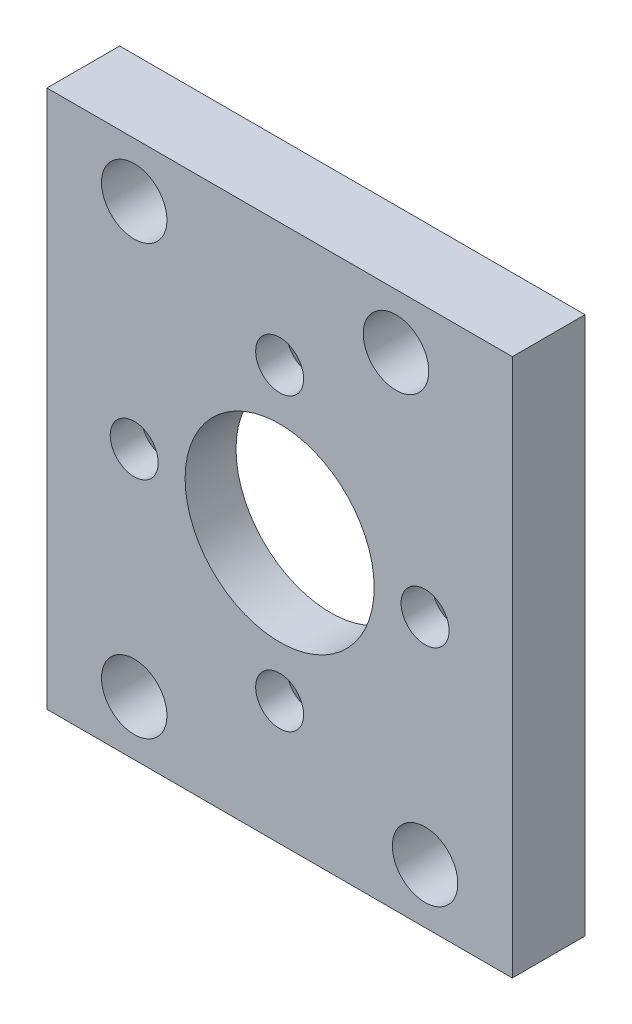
from build123d import *

# Parameters (mm, degrees)
ESQUISSE1_W                                    = 32
ESQUISSE1_H                                    = 37
ESQUISSE1_R                                    = 2.25
ESQUISSE1_R_2                                  = 6.5
EXTRUSION1_DEPTH                               = 5
FRAISAGE_POUR_VIS_T_TE_FRAIS_E_M31_D           = 3.3
FRAISAGE_POUR_VIS_T_TE_FRAIS_E_M31_CSINK_D     = 9
FRAISAGE_POUR_VIS_T_TE_FRAIS_E_M31_CSINK_ANGLE = 90
R_P_TITION_CIRCULAIRE2_COUNT                   = 4
ESQUISSE7_R                                    = 11
ENL_V_MAT_EXTRU_1_DEPTH                        = 1.5


with BuildPart() as part:
    # Esquisse1 → Extrusion1 (new body)
    with BuildSketch(Plane.XY):
        Rectangle(ESQUISSE1_W, ESQUISSE1_H)
        with Locations((10, -14.75)):
            Circle(ESQUISSE1_R, mode=Mode.SUBTRACT)
        with Locations((-10, -14.75)):
            Circle(ESQUISSE1_R, mode=Mode.SUBTRACT)
        Circle(ESQUISSE1_R_2, mode=Mode.SUBTRACT)
        with Locations((-10, 14.75)):
            Circle(ESQUISSE1_R, mode=Mode.SUBTRACT)
        with Locations((8, 14.75)):
            Circle(ESQUISSE1_R, mode=Mode.SUBTRACT)
    extrude(amount=EXTRUSION1_DEPTH)

    # Fraisage pour vis _ t_te frais_e M31 (through all)
    with Locations(Plane(origin=(0, 0, 0), x_dir=(-1, 0, 0), z_dir=(0, 0, -1))):
        with Locations((10, 0)):
            fraisage_pour_vis_t_te_frais_e_m31 = CounterSinkHole(FRAISAGE_POUR_VIS_T_TE_FRAIS_E_M31_D / 2, FRAISAGE_POUR_VIS_T_TE_FRAIS_E_M31_CSINK_D / 2, counter_sink_angle=FRAISAGE_POUR_VIS_T_TE_FRAIS_E_M31_CSINK_ANGLE)

    # R_p_tition circulaire2: Fraisage pour vis _ t_te frais_e M31 ×4 about axis
    r_p_tition_circulaire2_axis = Axis((0, 0, 0), (0, 0, 1))
    for i in range(1, R_P_TITION_CIRCULAIRE2_COUNT):
        add(fraisage_pour_vis_t_te_frais_e_m31.rotate(r_p_tition_circulaire2_axis, i * 360 / R_P_TITION_CIRCULAIRE2_COUNT), mode=Mode.SUBTRACT)

    # Esquisse7 → Enl_v. mat.-Extru.1 (cut)
    with BuildSketch(Plane(origin=(0, 0, 0), x_dir=(-1, 0, 0), z_dir=(0, 0, -1))):
        Circle(ESQUISSE7_R)
    extrude(amount=-ENL_V_MAT_EXTRU_1_DEPTH, mode=Mode.SUBTRACT)


solid = part.part
